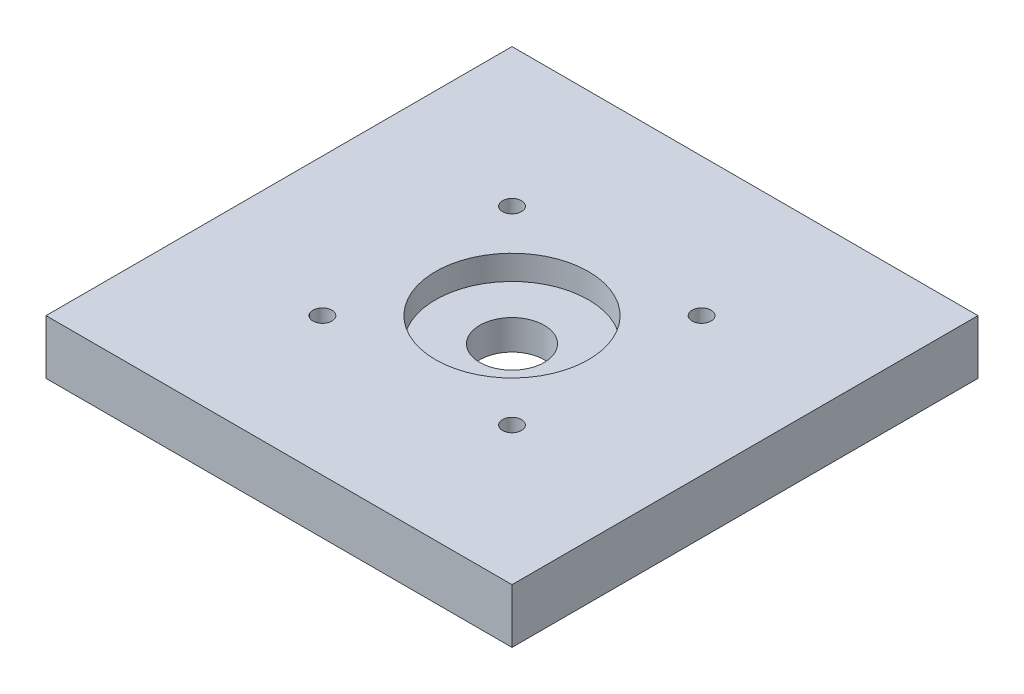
from build123d import *

# Parameters (mm, degrees)
SKETCH1_W           = 76.2
SKETCH1_H           = 76.2
SKETCH1_R           = 5.2705
SKETCH1_R_2         = 1.55
BOSS_EXTRUDE1_DEPTH = 8.89
SKETCH2_R           = 12.5
CUT_EXTRUDE1_DEPTH  = 4


with BuildPart() as part:
    # Sketch1 → Boss-Extrude1 (new body)
    with BuildSketch(Plane(origin=(0, 0, 0), x_dir=(1, 0, 0), z_dir=(0, 1, 0))):
        Rectangle(SKETCH1_W, SKETCH1_H)
        with Locations(Location((0, 0, 0), (0, 0, 270))):
            Circle(SKETCH1_R, mode=Mode.SUBTRACT)
        with Locations(Location((-15.5, 15.5, 0), (0, 0, 270))):
            Circle(SKETCH1_R_2, mode=Mode.SUBTRACT)
        with Locations(Location((15.5, 15.5, 0), (0, 0, 270))):
            Circle(SKETCH1_R_2, mode=Mode.SUBTRACT)
        with Locations(Location((15.5, -15.5, 0), (0, 0, 270))):
            Circle(SKETCH1_R_2, mode=Mode.SUBTRACT)
        with Locations(Location((-15.5, -15.5, 0), (0, 0, 270))):
            Circle(SKETCH1_R_2, mode=Mode.SUBTRACT)
    extrude(amount=BOSS_EXTRUDE1_DEPTH)

    # Sketch2 → Cut-Extrude1 (cut)
    with BuildSketch(Plane(origin=(0, 8.89, 0), x_dir=(1, 0, 0), z_dir=(0, 1, 0))):
        with Locations(Location((0, 0, 0), (0, 0, 270))):
            Circle(SKETCH2_R)
    extrude(amount=-CUT_EXTRUDE1_DEPTH, mode=Mode.SUBTRACT)


solid = part.part
